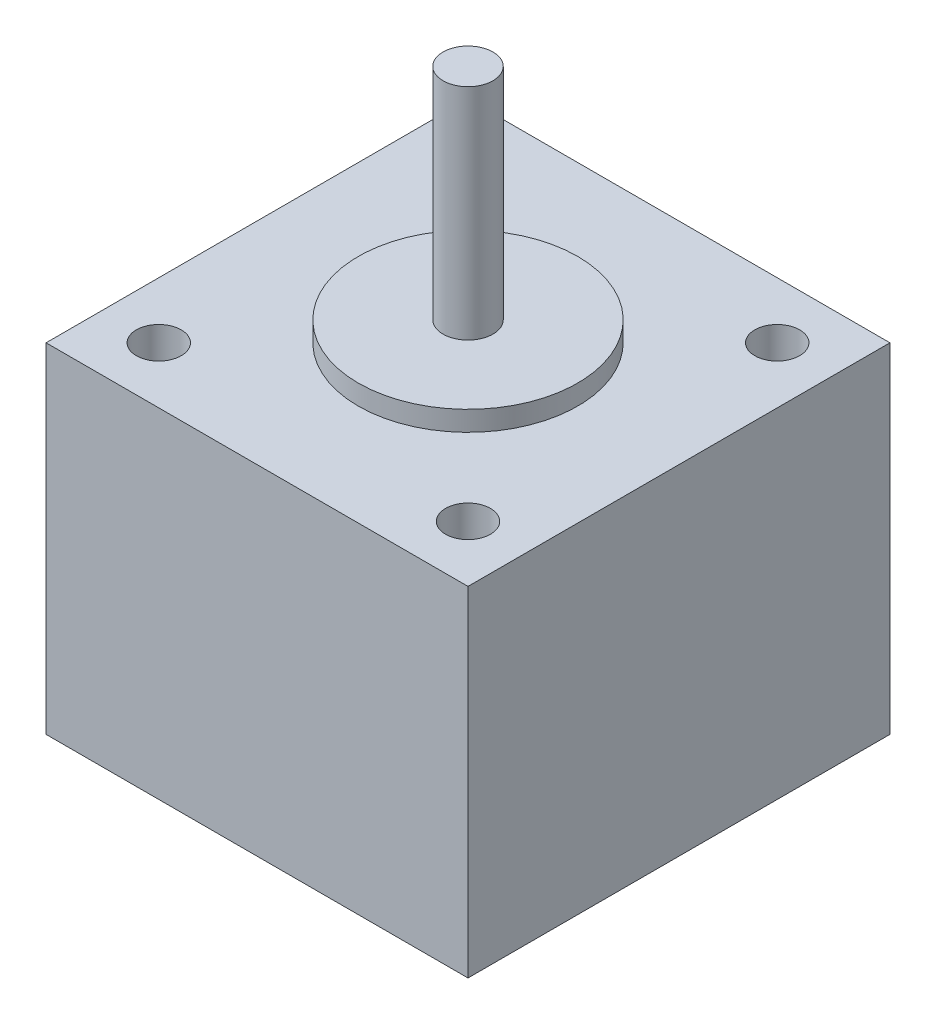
ISO-10303-21;
HEADER;
FILE_DESCRIPTION(('STEP AP214'),'2;1');
FILE_NAME('part.step','',(''),(''),'','','');
FILE_SCHEMA(('AUTOMOTIVE_DESIGN { 1 0 10303 214 1 1 1 1 }'));
ENDSEC;
DATA;
#1=APPLICATION_CONTEXT('core data for automotive mechanical design processes');
#2=APPLICATION_PROTOCOL_DEFINITION('international standard','automotive_design',2000,#1);
#3=PRODUCT_CONTEXT('',#1,'mechanical');
#4=PRODUCT('Part','Part','',(#3));
#5=PRODUCT_RELATED_PRODUCT_CATEGORY('part','',(#4));
#6=PRODUCT_DEFINITION_FORMATION('','',#4);
#7=PRODUCT_DEFINITION_CONTEXT('part definition',#1,'design');
#8=PRODUCT_DEFINITION('design','',#6,#7);
#9=PRODUCT_DEFINITION_SHAPE('','',#8);
#10=(LENGTH_UNIT() NAMED_UNIT(*) SI_UNIT(.MILLI.,.METRE.));
#11=(NAMED_UNIT(*) PLANE_ANGLE_UNIT() SI_UNIT($,.RADIAN.));
#12=(NAMED_UNIT(*) SI_UNIT($,.STERADIAN.) SOLID_ANGLE_UNIT());
#13=UNCERTAINTY_MEASURE_WITH_UNIT(LENGTH_MEASURE(1.E-05),#10,'distance_accuracy_value','');
#14=(GEOMETRIC_REPRESENTATION_CONTEXT(3) GLOBAL_UNCERTAINTY_ASSIGNED_CONTEXT((#13)) GLOBAL_UNIT_ASSIGNED_CONTEXT((#10,
#11,#12)) REPRESENTATION_CONTEXT('',''));
#15=CARTESIAN_POINT('',(0.,0.,0.));
#16=DIRECTION('',(0.,0.,1.));
#17=DIRECTION('',(1.,0.,0.));
#18=AXIS2_PLACEMENT_3D('',#15,#16,#17);
#19=CARTESIAN_POINT('',(-53.8836848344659,36.,7.4120112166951));
#20=DIRECTION('',(0.,1.,0.));
#21=DIRECTION('',(0.,0.,1.));
#22=AXIS2_PLACEMENT_3D('',#19,#20,#21);
#23=PLANE('',#22);
#24=CARTESIAN_POINT('',(-53.8836848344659,36.,7.4120112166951));
#25=DIRECTION('',(0.,1.,0.));
#26=DIRECTION('',(0.,0.,1.));
#27=AXIS2_PLACEMENT_3D('',#24,#25,#26);
#28=CIRCLE('',#27,11.);
#29=CARTESIAN_POINT('',(-53.8836848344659,36.,18.4120112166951));
#30=VERTEX_POINT('',#29);
#31=EDGE_CURVE('E100',#30,#30,#28,.T.);
#32=ORIENTED_EDGE('',*,*,#31,.T.);
#33=EDGE_LOOP('',(#32));
#34=FACE_BOUND('',#33,.T.);
#35=CARTESIAN_POINT('',(-53.8836848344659,36.,7.4120112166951));
#36=DIRECTION('',(0.,1.,0.));
#37=DIRECTION('',(0.,0.,1.));
#38=AXIS2_PLACEMENT_3D('',#35,#36,#37);
#39=CIRCLE('',#38,2.5);
#40=CARTESIAN_POINT('',(-53.8836848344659,36.,9.9120112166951));
#41=VERTEX_POINT('',#40);
#42=EDGE_CURVE('E117',#41,#41,#39,.T.);
#43=ORIENTED_EDGE('',*,*,#42,.F.);
#44=EDGE_LOOP('',(#43));
#45=FACE_BOUND('',#44,.T.);
#46=ADVANCED_FACE('F32',(#34,#45),#23,.T.);
#47=CARTESIAN_POINT('',(-75.0336848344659,34.,28.5620112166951));
#48=DIRECTION('',(0.,1.,0.));
#49=DIRECTION('',(0.,0.,1.));
#50=AXIS2_PLACEMENT_3D('',#47,#48,#49);
#51=PLANE('',#50);
#52=CARTESIAN_POINT('',(-69.3836848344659,34.,22.9120112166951));
#53=DIRECTION('',(0.,1.,0.));
#54=DIRECTION('',(0.,0.,1.));
#55=AXIS2_PLACEMENT_3D('',#52,#53,#54);
#56=CIRCLE('',#55,2.25);
#57=CARTESIAN_POINT('',(-69.3836848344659,34.,25.1620112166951));
#58=VERTEX_POINT('',#57);
#59=EDGE_CURVE('E141',#58,#58,#56,.T.);
#60=ORIENTED_EDGE('',*,*,#59,.F.);
#61=EDGE_LOOP('',(#60));
#62=FACE_BOUND('',#61,.T.);
#63=CARTESIAN_POINT('',(-38.3836848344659,34.,22.9120112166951));
#64=DIRECTION('',(0.,1.,0.));
#65=DIRECTION('',(0.,0.,1.));
#66=AXIS2_PLACEMENT_3D('',#63,#64,#65);
#67=CIRCLE('',#66,2.25);
#68=CARTESIAN_POINT('',(-38.3836848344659,34.,25.1620112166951));
#69=VERTEX_POINT('',#68);
#70=EDGE_CURVE('E135',#69,#69,#67,.T.);
#71=ORIENTED_EDGE('',*,*,#70,.F.);
#72=EDGE_LOOP('',(#71));
#73=FACE_BOUND('',#72,.T.);
#74=CARTESIAN_POINT('',(-38.3836848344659,34.,-8.0879887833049));
#75=DIRECTION('',(0.,1.,0.));
#76=DIRECTION('',(0.,0.,1.));
#77=AXIS2_PLACEMENT_3D('',#74,#75,#76);
#78=CIRCLE('',#77,2.25);
#79=CARTESIAN_POINT('',(-38.3836848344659,34.,-5.8379887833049));
#80=VERTEX_POINT('',#79);
#81=EDGE_CURVE('E129',#80,#80,#78,.T.);
#82=ORIENTED_EDGE('',*,*,#81,.F.);
#83=EDGE_LOOP('',(#82));
#84=FACE_BOUND('',#83,.T.);
#85=CARTESIAN_POINT('',(-69.3836848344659,34.,-8.0879887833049));
#86=DIRECTION('',(0.,1.,0.));
#87=DIRECTION('',(0.,0.,1.));
#88=AXIS2_PLACEMENT_3D('',#85,#86,#87);
#89=CIRCLE('',#88,2.25);
#90=CARTESIAN_POINT('',(-69.3836848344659,34.,-5.8379887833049));
#91=VERTEX_POINT('',#90);
#92=EDGE_CURVE('E123',#91,#91,#89,.T.);
#93=ORIENTED_EDGE('',*,*,#92,.F.);
#94=EDGE_LOOP('',(#93));
#95=FACE_BOUND('',#94,.T.);
#96=DIRECTION('',(0.,0.,1.));
#97=VECTOR('',#96,1.);
#98=CARTESIAN_POINT('',(-75.0336848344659,34.,-13.7379887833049));
#99=LINE('',#98,#97);
#100=CARTESIAN_POINT('',(-75.0336848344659,34.,-13.7379887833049));
#101=VERTEX_POINT('',#100);
#102=CARTESIAN_POINT('',(-75.0336848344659,34.,28.5620112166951));
#103=VERTEX_POINT('',#102);
#104=EDGE_CURVE('E85',#101,#103,#99,.T.);
#105=ORIENTED_EDGE('',*,*,#104,.T.);
#106=DIRECTION('',(1.,0.,0.));
#107=VECTOR('',#106,1.);
#108=CARTESIAN_POINT('',(-75.0336848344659,34.,28.5620112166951));
#109=LINE('',#108,#107);
#110=CARTESIAN_POINT('',(-32.7336848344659,34.,28.5620112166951));
#111=VERTEX_POINT('',#110);
#112=EDGE_CURVE('E79',#103,#111,#109,.T.);
#113=ORIENTED_EDGE('',*,*,#112,.T.);
#114=DIRECTION('',(0.,0.,-1.));
#115=VECTOR('',#114,1.);
#116=CARTESIAN_POINT('',(-32.7336848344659,34.,-13.7379887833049));
#117=LINE('',#116,#115);
#118=CARTESIAN_POINT('',(-32.7336848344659,34.,-13.7379887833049));
#119=VERTEX_POINT('',#118);
#120=EDGE_CURVE('E83',#111,#119,#117,.T.);
#121=ORIENTED_EDGE('',*,*,#120,.T.);
#122=DIRECTION('',(-1.,0.,0.));
#123=VECTOR('',#122,1.);
#124=CARTESIAN_POINT('',(-75.0336848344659,34.,-13.7379887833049));
#125=LINE('',#124,#123);
#126=EDGE_CURVE('E49',#119,#101,#125,.T.);
#127=ORIENTED_EDGE('',*,*,#126,.T.);
#128=EDGE_LOOP('',(#105,#113,#121,#127));
#129=FACE_BOUND('',#128,.T.);
#130=CARTESIAN_POINT('',(-53.8836848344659,34.,7.4120112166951));
#131=DIRECTION('',(0.,1.,0.));
#132=DIRECTION('',(0.,0.,1.));
#133=AXIS2_PLACEMENT_3D('',#130,#131,#132);
#134=CIRCLE('',#133,11.);
#135=CARTESIAN_POINT('',(-53.8836848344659,34.,18.4120112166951));
#136=VERTEX_POINT('',#135);
#137=EDGE_CURVE('E111',#136,#136,#134,.T.);
#138=ORIENTED_EDGE('',*,*,#137,.F.);
#139=EDGE_LOOP('',(#138));
#140=FACE_BOUND('',#139,.T.);
#141=ADVANCED_FACE('F80',(#62,#73,#84,#95,#129,#140),#51,.T.);
#142=CARTESIAN_POINT('',(-75.0336848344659,34.,-13.7379887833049));
#143=DIRECTION('',(1.,0.,0.));
#144=DIRECTION('',(0.,0.,-1.));
#145=AXIS2_PLACEMENT_3D('',#142,#143,#144);
#146=PLANE('',#145);
#147=DIRECTION('',(0.,0.,1.));
#148=VECTOR('',#147,1.);
#149=CARTESIAN_POINT('',(-75.0336848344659,0.,-13.7379887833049));
#150=LINE('',#149,#148);
#151=CARTESIAN_POINT('',(-75.0336848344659,0.,-13.7379887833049));
#152=VERTEX_POINT('',#151);
#153=CARTESIAN_POINT('',(-75.0336848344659,0.,28.5620112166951));
#154=VERTEX_POINT('',#153);
#155=EDGE_CURVE('E97',#152,#154,#150,.T.);
#156=ORIENTED_EDGE('',*,*,#155,.T.);
#157=DIRECTION('',(0.,-1.,0.));
#158=VECTOR('',#157,1.);
#159=CARTESIAN_POINT('',(-75.0336848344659,34.,28.5620112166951));
#160=LINE('',#159,#158);
#161=EDGE_CURVE('E11',#103,#154,#160,.T.);
#162=ORIENTED_EDGE('',*,*,#161,.F.);
#163=ORIENTED_EDGE('',*,*,#104,.F.);
#164=DIRECTION('',(0.,-1.,0.));
#165=VECTOR('',#164,1.);
#166=CARTESIAN_POINT('',(-75.0336848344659,34.,-13.7379887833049));
#167=LINE('',#166,#165);
#168=EDGE_CURVE('E93',#101,#152,#167,.T.);
#169=ORIENTED_EDGE('',*,*,#168,.T.);
#170=EDGE_LOOP('',(#156,#162,#163,#169));
#171=FACE_BOUND('',#170,.T.);
#172=ADVANCED_FACE('F34',(#171),#146,.F.);
#173=CARTESIAN_POINT('',(-75.0336848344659,34.,28.5620112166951));
#174=DIRECTION('',(0.,0.,-1.));
#175=DIRECTION('',(-1.,0.,0.));
#176=AXIS2_PLACEMENT_3D('',#173,#174,#175);
#177=PLANE('',#176);
#178=DIRECTION('',(1.,0.,0.));
#179=VECTOR('',#178,1.);
#180=CARTESIAN_POINT('',(-75.0336848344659,0.,28.5620112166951));
#181=LINE('',#180,#179);
#182=CARTESIAN_POINT('',(-32.7336848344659,0.,28.5620112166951));
#183=VERTEX_POINT('',#182);
#184=EDGE_CURVE('E89',#154,#183,#181,.T.);
#185=ORIENTED_EDGE('',*,*,#184,.T.);
#186=DIRECTION('',(0.,-1.,0.));
#187=VECTOR('',#186,1.);
#188=CARTESIAN_POINT('',(-32.7336848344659,34.,28.5620112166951));
#189=LINE('',#188,#187);
#190=EDGE_CURVE('E41',#111,#183,#189,.T.);
#191=ORIENTED_EDGE('',*,*,#190,.F.);
#192=ORIENTED_EDGE('',*,*,#112,.F.);
#193=ORIENTED_EDGE('',*,*,#161,.T.);
#194=EDGE_LOOP('',(#185,#191,#192,#193));
#195=FACE_BOUND('',#194,.T.);
#196=ADVANCED_FACE('F88',(#195),#177,.F.);
#197=CARTESIAN_POINT('',(-32.7336848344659,34.,-13.7379887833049));
#198=DIRECTION('',(-1.,0.,0.));
#199=DIRECTION('',(0.,0.,1.));
#200=AXIS2_PLACEMENT_3D('',#197,#198,#199);
#201=PLANE('',#200);
#202=DIRECTION('',(0.,0.,-1.));
#203=VECTOR('',#202,1.);
#204=CARTESIAN_POINT('',(-32.7336848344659,0.,-13.7379887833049));
#205=LINE('',#204,#203);
#206=CARTESIAN_POINT('',(-32.7336848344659,0.,-13.7379887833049));
#207=VERTEX_POINT('',#206);
#208=EDGE_CURVE('E66',#183,#207,#205,.T.);
#209=ORIENTED_EDGE('',*,*,#208,.T.);
#210=DIRECTION('',(0.,-1.,0.));
#211=VECTOR('',#210,1.);
#212=CARTESIAN_POINT('',(-32.7336848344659,34.,-13.7379887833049));
#213=LINE('',#212,#211);
#214=EDGE_CURVE('E90',#119,#207,#213,.T.);
#215=ORIENTED_EDGE('',*,*,#214,.F.);
#216=ORIENTED_EDGE('',*,*,#120,.F.);
#217=ORIENTED_EDGE('',*,*,#190,.T.);
#218=EDGE_LOOP('',(#209,#215,#216,#217));
#219=FACE_BOUND('',#218,.T.);
#220=ADVANCED_FACE('F91',(#219),#201,.F.);
#221=CARTESIAN_POINT('',(-75.0336848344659,34.,-13.7379887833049));
#222=DIRECTION('',(0.,0.,1.));
#223=DIRECTION('',(1.,0.,0.));
#224=AXIS2_PLACEMENT_3D('',#221,#222,#223);
#225=PLANE('',#224);
#226=DIRECTION('',(-1.,0.,0.));
#227=VECTOR('',#226,1.);
#228=CARTESIAN_POINT('',(-75.0336848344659,0.,-13.7379887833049));
#229=LINE('',#228,#227);
#230=EDGE_CURVE('E72',#207,#152,#229,.T.);
#231=ORIENTED_EDGE('',*,*,#230,.T.);
#232=ORIENTED_EDGE('',*,*,#168,.F.);
#233=ORIENTED_EDGE('',*,*,#126,.F.);
#234=ORIENTED_EDGE('',*,*,#214,.T.);
#235=EDGE_LOOP('',(#231,#232,#233,#234));
#236=FACE_BOUND('',#235,.T.);
#237=ADVANCED_FACE('F105',(#236),#225,.F.);
#238=CARTESIAN_POINT('',(-75.0336848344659,0.,28.5620112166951));
#239=DIRECTION('',(0.,1.,0.));
#240=DIRECTION('',(0.,0.,1.));
#241=AXIS2_PLACEMENT_3D('',#238,#239,#240);
#242=PLANE('',#241);
#243=ORIENTED_EDGE('',*,*,#155,.F.);
#244=ORIENTED_EDGE('',*,*,#230,.F.);
#245=ORIENTED_EDGE('',*,*,#208,.F.);
#246=ORIENTED_EDGE('',*,*,#184,.F.);
#247=EDGE_LOOP('',(#243,#244,#245,#246));
#248=FACE_BOUND('',#247,.T.);
#249=ADVANCED_FACE('F108',(#248),#242,.F.);
#250=CARTESIAN_POINT('',(-53.8836848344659,36.,7.4120112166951));
#251=DIRECTION('',(0.,-1.,0.));
#252=DIRECTION('',(0.,0.,-1.));
#253=AXIS2_PLACEMENT_3D('',#250,#251,#252);
#254=CYLINDRICAL_SURFACE('',#253,11.);
#255=ORIENTED_EDGE('',*,*,#31,.F.);
#256=EDGE_LOOP('',(#255));
#257=FACE_BOUND('',#256,.T.);
#258=ORIENTED_EDGE('',*,*,#137,.T.);
#259=EDGE_LOOP('',(#258));
#260=FACE_BOUND('',#259,.T.);
#261=ADVANCED_FACE('F190',(#257,#260),#254,.T.);
#262=CARTESIAN_POINT('',(-53.8836848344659,58.,7.4120112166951));
#263=DIRECTION('',(0.,-1.,0.));
#264=DIRECTION('',(0.,0.,-1.));
#265=AXIS2_PLACEMENT_3D('',#262,#263,#264);
#266=CYLINDRICAL_SURFACE('',#265,2.5);
#267=CARTESIAN_POINT('',(-53.8836848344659,58.,7.4120112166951));
#268=DIRECTION('',(0.,1.,0.));
#269=DIRECTION('',(0.,0.,1.));
#270=AXIS2_PLACEMENT_3D('',#267,#268,#269);
#271=CIRCLE('',#270,2.5);
#272=CARTESIAN_POINT('',(-53.8836848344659,58.,9.9120112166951));
#273=VERTEX_POINT('',#272);
#274=EDGE_CURVE('E114',#273,#273,#271,.T.);
#275=ORIENTED_EDGE('',*,*,#274,.F.);
#276=EDGE_LOOP('',(#275));
#277=FACE_BOUND('',#276,.T.);
#278=ORIENTED_EDGE('',*,*,#42,.T.);
#279=EDGE_LOOP('',(#278));
#280=FACE_BOUND('',#279,.T.);
#281=ADVANCED_FACE('F178',(#277,#280),#266,.T.);
#282=CARTESIAN_POINT('',(-53.8836848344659,58.,7.4120112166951));
#283=DIRECTION('',(0.,1.,0.));
#284=DIRECTION('',(0.,0.,1.));
#285=AXIS2_PLACEMENT_3D('',#282,#283,#284);
#286=PLANE('',#285);
#287=ORIENTED_EDGE('',*,*,#274,.T.);
#288=EDGE_LOOP('',(#287));
#289=FACE_BOUND('',#288,.T.);
#290=ADVANCED_FACE('F168',(#289),#286,.T.);
#291=CARTESIAN_POINT('',(-69.3836848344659,30.,-8.0879887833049));
#292=DIRECTION('',(0.,1.,0.));
#293=DIRECTION('',(0.,0.,1.));
#294=AXIS2_PLACEMENT_3D('',#291,#292,#293);
#295=CYLINDRICAL_SURFACE('',#294,2.25);
#296=CARTESIAN_POINT('',(-69.3836848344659,30.,-8.0879887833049));
#297=DIRECTION('',(0.,1.,0.));
#298=DIRECTION('',(0.,0.,1.));
#299=AXIS2_PLACEMENT_3D('',#296,#297,#298);
#300=CIRCLE('',#299,2.25);
#301=CARTESIAN_POINT('',(-69.3836848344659,30.,-5.8379887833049));
#302=VERTEX_POINT('',#301);
#303=EDGE_CURVE('E120',#302,#302,#300,.T.);
#304=ORIENTED_EDGE('',*,*,#303,.F.);
#305=EDGE_LOOP('',(#304));
#306=FACE_BOUND('',#305,.T.);
#307=ORIENTED_EDGE('',*,*,#92,.T.);
#308=EDGE_LOOP('',(#307));
#309=FACE_BOUND('',#308,.T.);
#310=ADVANCED_FACE('F165',(#306,#309),#295,.F.);
#311=CARTESIAN_POINT('',(-69.3836848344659,30.,-8.0879887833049));
#312=DIRECTION('',(0.,1.,0.));
#313=DIRECTION('',(0.,0.,1.));
#314=AXIS2_PLACEMENT_3D('',#311,#312,#313);
#315=PLANE('',#314);
#316=ORIENTED_EDGE('',*,*,#303,.T.);
#317=EDGE_LOOP('',(#316));
#318=FACE_BOUND('',#317,.T.);
#319=ADVANCED_FACE('F167',(#318),#315,.T.);
#320=CARTESIAN_POINT('',(-38.3836848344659,30.,-8.0879887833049));
#321=DIRECTION('',(0.,1.,0.));
#322=DIRECTION('',(0.,0.,1.));
#323=AXIS2_PLACEMENT_3D('',#320,#321,#322);
#324=CYLINDRICAL_SURFACE('',#323,2.25);
#325=CARTESIAN_POINT('',(-38.3836848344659,30.,-8.0879887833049));
#326=DIRECTION('',(0.,1.,0.));
#327=DIRECTION('',(0.,0.,1.));
#328=AXIS2_PLACEMENT_3D('',#325,#326,#327);
#329=CIRCLE('',#328,2.25);
#330=CARTESIAN_POINT('',(-38.3836848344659,30.,-5.8379887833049));
#331=VERTEX_POINT('',#330);
#332=EDGE_CURVE('E126',#331,#331,#329,.T.);
#333=ORIENTED_EDGE('',*,*,#332,.F.);
#334=EDGE_LOOP('',(#333));
#335=FACE_BOUND('',#334,.T.);
#336=ORIENTED_EDGE('',*,*,#81,.T.);
#337=EDGE_LOOP('',(#336));
#338=FACE_BOUND('',#337,.T.);
#339=ADVANCED_FACE('F175',(#335,#338),#324,.F.);
#340=CARTESIAN_POINT('',(-38.3836848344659,30.,-8.0879887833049));
#341=DIRECTION('',(0.,1.,0.));
#342=DIRECTION('',(0.,0.,1.));
#343=AXIS2_PLACEMENT_3D('',#340,#341,#342);
#344=PLANE('',#343);
#345=ORIENTED_EDGE('',*,*,#332,.T.);
#346=EDGE_LOOP('',(#345));
#347=FACE_BOUND('',#346,.T.);
#348=ADVANCED_FACE('F234',(#347),#344,.T.);
#349=CARTESIAN_POINT('',(-38.3836848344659,30.,22.9120112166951));
#350=DIRECTION('',(0.,1.,0.));
#351=DIRECTION('',(0.,0.,1.));
#352=AXIS2_PLACEMENT_3D('',#349,#350,#351);
#353=CYLINDRICAL_SURFACE('',#352,2.25);
#354=CARTESIAN_POINT('',(-38.3836848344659,30.,22.9120112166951));
#355=DIRECTION('',(0.,1.,0.));
#356=DIRECTION('',(0.,0.,1.));
#357=AXIS2_PLACEMENT_3D('',#354,#355,#356);
#358=CIRCLE('',#357,2.25);
#359=CARTESIAN_POINT('',(-38.3836848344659,30.,25.1620112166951));
#360=VERTEX_POINT('',#359);
#361=EDGE_CURVE('E132',#360,#360,#358,.T.);
#362=ORIENTED_EDGE('',*,*,#361,.F.);
#363=EDGE_LOOP('',(#362));
#364=FACE_BOUND('',#363,.T.);
#365=ORIENTED_EDGE('',*,*,#70,.T.);
#366=EDGE_LOOP('',(#365));
#367=FACE_BOUND('',#366,.T.);
#368=ADVANCED_FACE('F244',(#364,#367),#353,.F.);
#369=CARTESIAN_POINT('',(-38.3836848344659,30.,22.9120112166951));
#370=DIRECTION('',(0.,1.,0.));
#371=DIRECTION('',(0.,0.,1.));
#372=AXIS2_PLACEMENT_3D('',#369,#370,#371);
#373=PLANE('',#372);
#374=ORIENTED_EDGE('',*,*,#361,.T.);
#375=EDGE_LOOP('',(#374));
#376=FACE_BOUND('',#375,.T.);
#377=ADVANCED_FACE('F152',(#376),#373,.T.);
#378=CARTESIAN_POINT('',(-69.3836848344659,30.,22.9120112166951));
#379=DIRECTION('',(0.,1.,0.));
#380=DIRECTION('',(0.,0.,1.));
#381=AXIS2_PLACEMENT_3D('',#378,#379,#380);
#382=CYLINDRICAL_SURFACE('',#381,2.25);
#383=CARTESIAN_POINT('',(-69.3836848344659,30.,22.9120112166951));
#384=DIRECTION('',(0.,1.,0.));
#385=DIRECTION('',(0.,0.,1.));
#386=AXIS2_PLACEMENT_3D('',#383,#384,#385);
#387=CIRCLE('',#386,2.25);
#388=CARTESIAN_POINT('',(-69.3836848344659,30.,25.1620112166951));
#389=VERTEX_POINT('',#388);
#390=EDGE_CURVE('E138',#389,#389,#387,.T.);
#391=ORIENTED_EDGE('',*,*,#390,.F.);
#392=EDGE_LOOP('',(#391));
#393=FACE_BOUND('',#392,.T.);
#394=ORIENTED_EDGE('',*,*,#59,.T.);
#395=EDGE_LOOP('',(#394));
#396=FACE_BOUND('',#395,.T.);
#397=ADVANCED_FACE('F149',(#393,#396),#382,.F.);
#398=CARTESIAN_POINT('',(-69.3836848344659,30.,22.9120112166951));
#399=DIRECTION('',(0.,1.,0.));
#400=DIRECTION('',(0.,0.,1.));
#401=AXIS2_PLACEMENT_3D('',#398,#399,#400);
#402=PLANE('',#401);
#403=ORIENTED_EDGE('',*,*,#390,.T.);
#404=EDGE_LOOP('',(#403));
#405=FACE_BOUND('',#404,.T.);
#406=ADVANCED_FACE('F147',(#405),#402,.T.);
#407=CLOSED_SHELL('',(#46,#141,#172,#196,#220,#237,#249,#261,#281,#290,#310,#319,#339,#348,#368,
#377,#397,#406));
#408=MANIFOLD_SOLID_BREP('B2',#407);
#409=ADVANCED_BREP_SHAPE_REPRESENTATION('',(#18,#408),#14);
#410=SHAPE_DEFINITION_REPRESENTATION(#9,#409);
ENDSEC;
END-ISO-10303-21;
